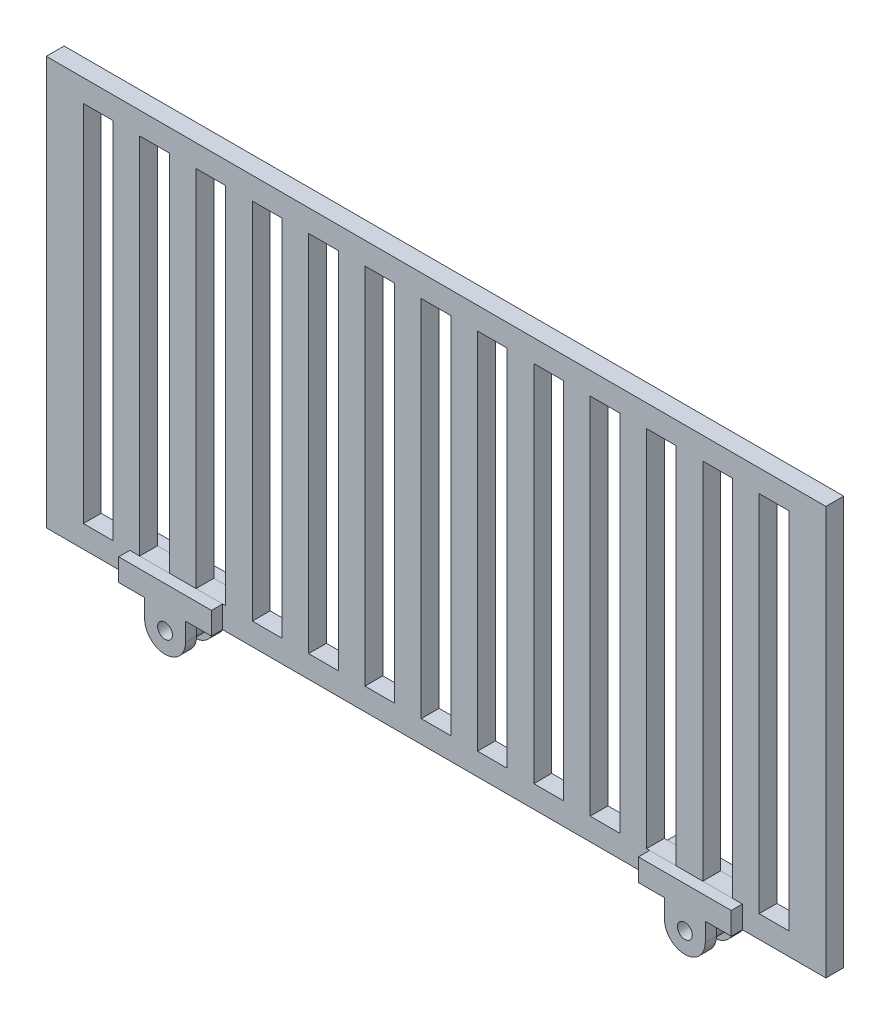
from build123d import *

# Parameters (mm, degrees)
SKETCH13_W             = 210
SKETCH13_H             = 110
BOSS_EXTRUDE10_DEPTH   = 2.4
SKETCH14_W             = 8
SKETCH14_H             = 98
CUT_EXTRUDE4_DEPTH     = 4.8
LPATTERN1_COUNT        = 13
LPATTERN1_PITCH        = 15.166666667
SKETCH15_R             = 4
SKETCH15_R_2           = 2
BOSS_EXTRUDE11_DEPTH   = 4.8
BOSS_EXTRUDE11_2_DEPTH = 4.8
SKETCH16_R             = 2
BOSS_EXTRUDE12_DEPTH   = 3


with BuildPart() as part:
    # Sketch13 → Boss-Extrude10 (new, symmetric)
    with BuildSketch(Plane.XY):
        Rectangle(SKETCH13_W, SKETCH13_H)
    extrude(amount=BOSS_EXTRUDE10_DEPTH, both=True)

    # Sketch14 → Cut-Extrude4 (cut)
    with BuildSketch(Plane.XY.offset(2.4)):
        with Locations((-91, 0)):
            Rectangle(SKETCH14_W, SKETCH14_H)
    cut_extrude4 = extrude(amount=-CUT_EXTRUDE4_DEPTH, mode=Mode.SUBTRACT)

    # LPattern1: Cut-Extrude4 ×13
    with Locations(*[(i * LPATTERN1_PITCH, 0, 0) for i in range(1, LPATTERN1_COUNT)]):
        add(cut_extrude4, mode=Mode.SUBTRACT)


with BuildPart() as body_2:
    # Sketch15 → Boss-Extrude11 (new body)
    with BuildSketch(Plane.XY.offset(2.4)):
        with Locations((-70, -60)):
            Circle(SKETCH15_R)
        with Locations((-70, -60)):
            Circle(SKETCH15_R_2, mode=Mode.SUBTRACT)
    extrude(amount=-BOSS_EXTRUDE11_DEPTH)


with BuildPart() as body_3:
    # Sketch15 → Boss-Extrude11 2 (new body)
    with BuildSketch(Plane.XY.offset(2.4)):
        with Locations((70, -60)):
            Circle(SKETCH15_R)
        with Locations((70, -60)):
            Circle(SKETCH15_R_2, mode=Mode.SUBTRACT)
    extrude(amount=-BOSS_EXTRUDE11_2_DEPTH)


with BuildPart() as body_4:
    # Sketch16 → Boss-Extrude12 (new body)
    with BuildSketch(Plane.XY.offset(2.4)):
        with BuildLine():
            Line((-75.5, -60), (-75.5, -55))
            Line((-75.5, -55), (-82.5, -55))
            Line((-82.5, -55), (-82.5, -49))
            Line((-82.5, -49), (-57.5, -49))
            Line((-57.5, -49), (-57.5, -55))
            Line((-57.5, -55), (-64.5, -55))
            Line((-64.5, -55), (-64.5, -60))
            ThreePointArc((-64.5, -60), (-70, -65.5), (-75.5, -60))
        make_face()
        with Locations((-70, -60)):
            Circle(SKETCH16_R, mode=Mode.SUBTRACT)
    extrude(amount=BOSS_EXTRUDE12_DEPTH)


with BuildPart() as body_5:
    # Mirror1: mirrored copy
    add(body_4.part.mirror(Plane.XY))


with BuildPart() as body_6:
    # Mirror2: mirrored copy
    add(body_5.part.mirror(Plane(origin=(0, 0, 0), x_dir=(0, 0, 1), z_dir=(1, 0, 0))))


with BuildPart() as body_7:
    # Mirror2 2: mirrored copy
    add(body_4.part.mirror(Plane(origin=(0, 0, 0), x_dir=(0, 0, 1), z_dir=(1, 0, 0))))


solid = Compound([part.part, body_2.part, body_3.part, body_4.part, body_5.part, body_6.part, body_7.part])
